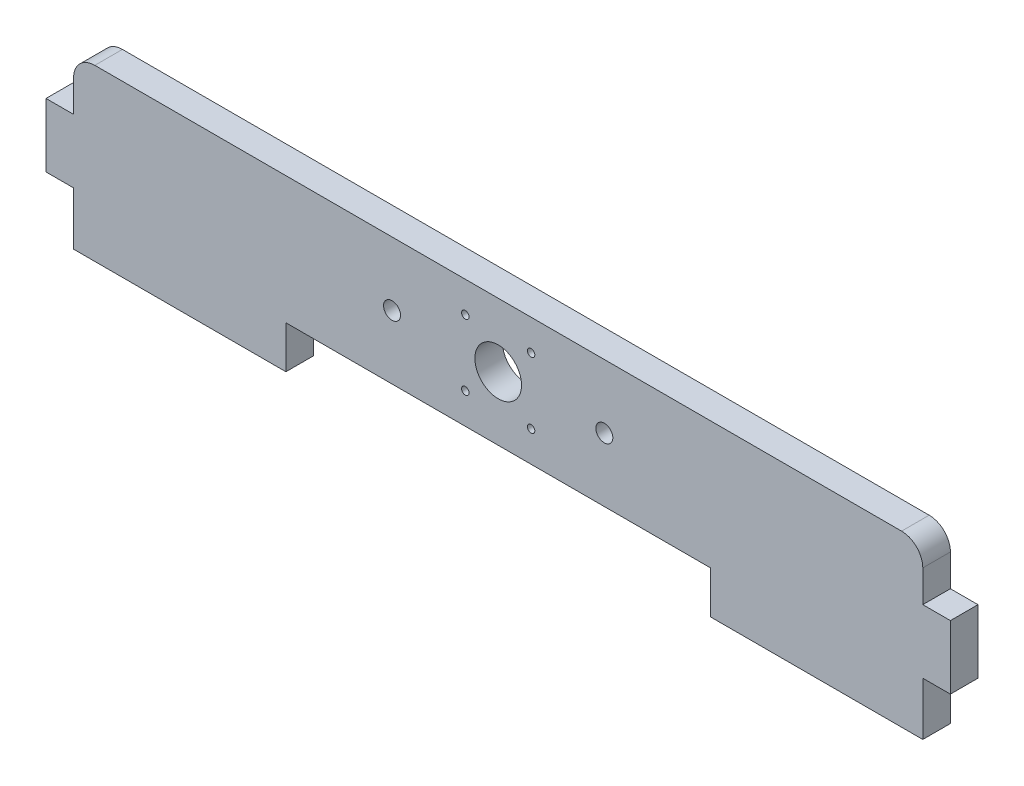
from build123d import *

# Parameters (mm, degrees)
SALIENTE_EXTRUIR1_DEPTH = 13
CROQUIS2_R              = 11
CROQUIS2_R_2            = 4
CROQUIS2_R_3            = 1.75
CORTAR_EXTRUIR1_DEPTH   = 13
REDONDEO1_R             = 10
REDONDEO2_R             = 10


with BuildPart() as part:
    # Croquis1 → Saliente-Extruir1 (new body)
    with BuildSketch(Plane.XY):
        Polygon((100, -40), (200, -40), (200, -15), (213, -15), (213, 15), (200, 15), (200, 40), (-200, 40), (-200, 15), (-213, 15), (-213, -15), (-200, -15), (-200, -40), (-100, -40), (-100, -20), (100, -20), align=None)
    extrude(amount=SALIENTE_EXTRUIR1_DEPTH)

    # Croquis2 → Cortar-Extruir1 (cut)
    with BuildSketch(Plane(origin=(0, 0, 0), x_dir=(-1, 0, 0), z_dir=(0, 0, -1))):
        with Locations((0, 10)):
            Circle(CROQUIS2_R)
        with Locations((50, 10)):
            Circle(CROQUIS2_R_2)
        with Locations((-50, 10)):
            Circle(CROQUIS2_R_2)
        with Locations((15.5, 25.5)):
            Circle(CROQUIS2_R_3)
        with Locations((15.5, -5.5)):
            Circle(CROQUIS2_R_3)
        with Locations((-15.5, 25.5)):
            Circle(CROQUIS2_R_3)
        with Locations((-15.5, -5.5)):
            Circle(CROQUIS2_R_3)
    extrude(amount=-CORTAR_EXTRUIR1_DEPTH, mode=Mode.SUBTRACT)

    # Redondeo1
    redondeo1_edges = [part.edges().sort_by_distance(p)[0] for p in [
        (-200, 40, 6.5),
    ]]
    fillet(redondeo1_edges, radius=REDONDEO1_R)

    # Redondeo2
    redondeo2_edges = [part.edges().sort_by_distance(p)[0] for p in [
        (200, 40, 6.5),
    ]]
    fillet(redondeo2_edges, radius=REDONDEO2_R)


solid = part.part
